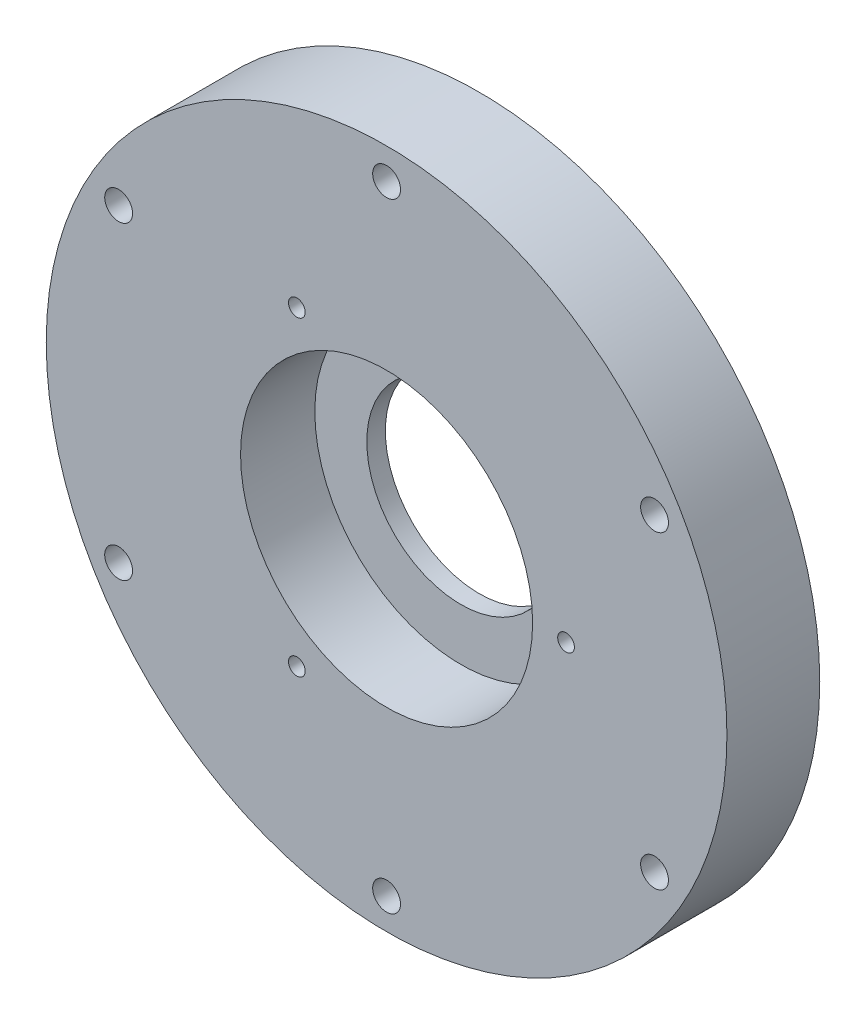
ISO-10303-21;
HEADER;
FILE_DESCRIPTION(('STEP AP214'),'2;1');
FILE_NAME('part.step','',(''),(''),'','','');
FILE_SCHEMA(('AUTOMOTIVE_DESIGN { 1 0 10303 214 1 1 1 1 }'));
ENDSEC;
DATA;
#1=APPLICATION_CONTEXT('core data for automotive mechanical design processes');
#2=APPLICATION_PROTOCOL_DEFINITION('international standard','automotive_design',2000,#1);
#3=PRODUCT_CONTEXT('',#1,'mechanical');
#4=PRODUCT('Part','Part','',(#3));
#5=PRODUCT_RELATED_PRODUCT_CATEGORY('part','',(#4));
#6=PRODUCT_DEFINITION_FORMATION('','',#4);
#7=PRODUCT_DEFINITION_CONTEXT('part definition',#1,'design');
#8=PRODUCT_DEFINITION('design','',#6,#7);
#9=PRODUCT_DEFINITION_SHAPE('','',#8);
#10=(LENGTH_UNIT() NAMED_UNIT(*) SI_UNIT(.MILLI.,.METRE.));
#11=(NAMED_UNIT(*) PLANE_ANGLE_UNIT() SI_UNIT($,.RADIAN.));
#12=(NAMED_UNIT(*) SI_UNIT($,.STERADIAN.) SOLID_ANGLE_UNIT());
#13=UNCERTAINTY_MEASURE_WITH_UNIT(LENGTH_MEASURE(1.E-05),#10,'distance_accuracy_value','');
#14=(GEOMETRIC_REPRESENTATION_CONTEXT(3) GLOBAL_UNCERTAINTY_ASSIGNED_CONTEXT((#13)) GLOBAL_UNIT_ASSIGNED_CONTEXT((#10,
#11,#12)) REPRESENTATION_CONTEXT('',''));
#15=CARTESIAN_POINT('',(0.,0.,0.));
#16=DIRECTION('',(0.,0.,1.));
#17=DIRECTION('',(1.,0.,0.));
#18=AXIS2_PLACEMENT_3D('',#15,#16,#17);
#19=CARTESIAN_POINT('',(29.,0.,6.));
#20=DIRECTION('',(0.,0.,1.));
#21=DIRECTION('',(1.,0.,0.));
#22=AXIS2_PLACEMENT_3D('',#19,#20,#21);
#23=PLANE('',#22);
#24=CARTESIAN_POINT('',(29.,0.,6.));
#25=DIRECTION('',(0.,0.,1.));
#26=DIRECTION('',(1.,0.,0.));
#27=AXIS2_PLACEMENT_3D('',#24,#25,#26);
#28=CIRCLE('',#27,1.35);
#29=CARTESIAN_POINT('',(30.35,0.,6.));
#30=VERTEX_POINT('',#29);
#31=EDGE_CURVE('E9',#30,#30,#28,.T.);
#32=ORIENTED_EDGE('',*,*,#31,.T.);
#33=EDGE_LOOP('',(#32));
#34=FACE_BOUND('',#33,.T.);
#35=ADVANCED_FACE('F14',(#34),#23,.T.);
#36=CARTESIAN_POINT('',(29.,0.,6.));
#37=DIRECTION('',(0.,0.,1.));
#38=DIRECTION('',(1.,0.,0.));
#39=AXIS2_PLACEMENT_3D('',#36,#37,#38);
#40=PLANE('',#39);
#41=CARTESIAN_POINT('',(-14.5,25.114736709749,6.));
#42=DIRECTION('',(0.,0.,1.));
#43=DIRECTION('',(1.,0.,0.));
#44=AXIS2_PLACEMENT_3D('',#41,#42,#43);
#45=CIRCLE('',#44,1.35);
#46=CARTESIAN_POINT('',(-13.15,25.114736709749,6.));
#47=VERTEX_POINT('',#46);
#48=EDGE_CURVE('E32',#47,#47,#45,.T.);
#49=ORIENTED_EDGE('',*,*,#48,.T.);
#50=EDGE_LOOP('',(#49));
#51=FACE_BOUND('',#50,.T.);
#52=ADVANCED_FACE('F16',(#51),#40,.T.);
#53=CARTESIAN_POINT('',(29.,0.,6.));
#54=DIRECTION('',(0.,0.,1.));
#55=DIRECTION('',(1.,0.,0.));
#56=AXIS2_PLACEMENT_3D('',#53,#54,#55);
#57=PLANE('',#56);
#58=CARTESIAN_POINT('',(-14.5,-25.11473670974,6.));
#59=DIRECTION('',(0.,0.,1.));
#60=DIRECTION('',(1.,0.,0.));
#61=AXIS2_PLACEMENT_3D('',#58,#59,#60);
#62=CIRCLE('',#61,1.35);
#63=CARTESIAN_POINT('',(-13.15,-25.11473670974,6.));
#64=VERTEX_POINT('',#63);
#65=EDGE_CURVE('E50',#64,#64,#62,.T.);
#66=ORIENTED_EDGE('',*,*,#65,.T.);
#67=EDGE_LOOP('',(#66));
#68=FACE_BOUND('',#67,.T.);
#69=ADVANCED_FACE('F256',(#68),#57,.T.);
#70=CARTESIAN_POINT('',(43.,0.,2.));
#71=DIRECTION('',(0.,0.,1.));
#72=DIRECTION('',(1.,0.,0.));
#73=AXIS2_PLACEMENT_3D('',#70,#71,#72);
#74=PLANE('',#73);
#75=CARTESIAN_POINT('',(13.287730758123,40.895430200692,2.));
#76=DIRECTION('',(0.,0.,1.));
#77=DIRECTION('',(1.,0.,0.));
#78=AXIS2_PLACEMENT_3D('',#75,#76,#77);
#79=CIRCLE('',#78,4.1);
#80=CARTESIAN_POINT('',(17.387730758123,40.895430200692,2.));
#81=VERTEX_POINT('',#80);
#82=EDGE_CURVE('E42',#81,#81,#79,.T.);
#83=ORIENTED_EDGE('',*,*,#82,.F.);
#84=EDGE_LOOP('',(#83));
#85=FACE_BOUND('',#84,.T.);
#86=ADVANCED_FACE('F306',(#85),#74,.F.);
#87=CARTESIAN_POINT('',(43.,0.,2.));
#88=DIRECTION('',(0.,0.,1.));
#89=DIRECTION('',(1.,0.,0.));
#90=AXIS2_PLACEMENT_3D('',#87,#88,#89);
#91=PLANE('',#90);
#92=CARTESIAN_POINT('',(34.787730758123,25.274765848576,2.));
#93=DIRECTION('',(0.,0.,1.));
#94=DIRECTION('',(1.,0.,0.));
#95=AXIS2_PLACEMENT_3D('',#92,#93,#94);
#96=CIRCLE('',#95,4.1);
#97=CARTESIAN_POINT('',(38.887730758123,25.274765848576,2.));
#98=VERTEX_POINT('',#97);
#99=EDGE_CURVE('E41',#98,#98,#96,.T.);
#100=ORIENTED_EDGE('',*,*,#99,.F.);
#101=EDGE_LOOP('',(#100));
#102=FACE_BOUND('',#101,.T.);
#103=ADVANCED_FACE('F308',(#102),#91,.F.);
#104=CARTESIAN_POINT('',(43.,0.,2.));
#105=DIRECTION('',(0.,0.,1.));
#106=DIRECTION('',(1.,0.,0.));
#107=AXIS2_PLACEMENT_3D('',#104,#105,#106);
#108=PLANE('',#107);
#109=CARTESIAN_POINT('',(43.,0.,2.));
#110=DIRECTION('',(0.,0.,1.));
#111=DIRECTION('',(1.,0.,0.));
#112=AXIS2_PLACEMENT_3D('',#109,#110,#111);
#113=CIRCLE('',#112,4.1);
#114=CARTESIAN_POINT('',(47.1,0.,2.));
#115=VERTEX_POINT('',#114);
#116=EDGE_CURVE('E37',#115,#115,#113,.T.);
#117=ORIENTED_EDGE('',*,*,#116,.F.);
#118=EDGE_LOOP('',(#117));
#119=FACE_BOUND('',#118,.T.);
#120=ADVANCED_FACE('F305',(#119),#108,.F.);
#121=CARTESIAN_POINT('',(0.,0.,3.));
#122=DIRECTION('',(0.,0.,1.));
#123=DIRECTION('',(1.,0.,0.));
#124=AXIS2_PLACEMENT_3D('',#121,#122,#123);
#125=PLANE('',#124);
#126=CARTESIAN_POINT('',(0.,0.,3.));
#127=DIRECTION('',(0.,0.,-1.));
#128=DIRECTION('',(1.,0.,0.));
#129=AXIS2_PLACEMENT_3D('',#126,#127,#128);
#130=CIRCLE('',#129,15.2);
#131=CARTESIAN_POINT('',(15.2,0.,3.));
#132=VERTEX_POINT('',#131);
#133=EDGE_CURVE('E40',#132,#132,#130,.T.);
#134=ORIENTED_EDGE('',*,*,#133,.T.);
#135=EDGE_LOOP('',(#134));
#136=FACE_BOUND('',#135,.T.);
#137=CARTESIAN_POINT('',(0.,0.,3.));
#138=DIRECTION('',(0.,0.,1.));
#139=DIRECTION('',(1.,0.,0.));
#140=AXIS2_PLACEMENT_3D('',#137,#138,#139);
#141=CIRCLE('',#140,23.6);
#142=CARTESIAN_POINT('',(23.6,0.,3.));
#143=VERTEX_POINT('',#142);
#144=EDGE_CURVE('E18',#143,#143,#141,.T.);
#145=ORIENTED_EDGE('',*,*,#144,.T.);
#146=EDGE_LOOP('',(#145));
#147=FACE_BOUND('',#146,.T.);
#148=ADVANCED_FACE('F297',(#136,#147),#125,.T.);
#149=CARTESIAN_POINT('',(43.,0.,2.));
#150=DIRECTION('',(0.,0.,1.));
#151=DIRECTION('',(1.,0.,0.));
#152=AXIS2_PLACEMENT_3D('',#149,#150,#151);
#153=PLANE('',#152);
#154=CARTESIAN_POINT('',(-13.28773075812,40.895430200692,2.));
#155=DIRECTION('',(0.,0.,1.));
#156=DIRECTION('',(1.,0.,0.));
#157=AXIS2_PLACEMENT_3D('',#154,#155,#156);
#158=CIRCLE('',#157,4.1);
#159=CARTESIAN_POINT('',(-9.18773075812,40.895430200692,2.));
#160=VERTEX_POINT('',#159);
#161=EDGE_CURVE('E34',#160,#160,#158,.T.);
#162=ORIENTED_EDGE('',*,*,#161,.F.);
#163=EDGE_LOOP('',(#162));
#164=FACE_BOUND('',#163,.T.);
#165=ADVANCED_FACE('F292',(#164),#153,.F.);
#166=CARTESIAN_POINT('',(43.,0.,2.));
#167=DIRECTION('',(0.,0.,1.));
#168=DIRECTION('',(1.,0.,0.));
#169=AXIS2_PLACEMENT_3D('',#166,#167,#168);
#170=PLANE('',#169);
#171=CARTESIAN_POINT('',(-34.78773075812,25.274765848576,2.));
#172=DIRECTION('',(0.,0.,1.));
#173=DIRECTION('',(1.,0.,0.));
#174=AXIS2_PLACEMENT_3D('',#171,#172,#173);
#175=CIRCLE('',#174,4.1);
#176=CARTESIAN_POINT('',(-30.68773075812,25.274765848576,2.));
#177=VERTEX_POINT('',#176);
#178=EDGE_CURVE('E103',#177,#177,#175,.T.);
#179=ORIENTED_EDGE('',*,*,#178,.F.);
#180=EDGE_LOOP('',(#179));
#181=FACE_BOUND('',#180,.T.);
#182=ADVANCED_FACE('F289',(#181),#170,.F.);
#183=CARTESIAN_POINT('',(43.,0.,2.));
#184=DIRECTION('',(0.,0.,1.));
#185=DIRECTION('',(1.,0.,0.));
#186=AXIS2_PLACEMENT_3D('',#183,#184,#185);
#187=PLANE('',#186);
#188=CARTESIAN_POINT('',(-43.,0.,2.));
#189=DIRECTION('',(0.,0.,1.));
#190=DIRECTION('',(1.,0.,0.));
#191=AXIS2_PLACEMENT_3D('',#188,#189,#190);
#192=CIRCLE('',#191,4.1);
#193=CARTESIAN_POINT('',(-38.9,0.,2.));
#194=VERTEX_POINT('',#193);
#195=EDGE_CURVE('E105',#194,#194,#192,.T.);
#196=ORIENTED_EDGE('',*,*,#195,.F.);
#197=EDGE_LOOP('',(#196));
#198=FACE_BOUND('',#197,.T.);
#199=ADVANCED_FACE('F286',(#198),#187,.F.);
#200=CARTESIAN_POINT('',(43.,0.,2.));
#201=DIRECTION('',(0.,0.,1.));
#202=DIRECTION('',(1.,0.,0.));
#203=AXIS2_PLACEMENT_3D('',#200,#201,#202);
#204=PLANE('',#203);
#205=CARTESIAN_POINT('',(34.787730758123,-25.27476584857,2.));
#206=DIRECTION('',(0.,0.,1.));
#207=DIRECTION('',(1.,0.,0.));
#208=AXIS2_PLACEMENT_3D('',#205,#206,#207);
#209=CIRCLE('',#208,4.1);
#210=CARTESIAN_POINT('',(38.887730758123,-25.27476584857,2.));
#211=VERTEX_POINT('',#210);
#212=EDGE_CURVE('E97',#211,#211,#209,.T.);
#213=ORIENTED_EDGE('',*,*,#212,.F.);
#214=EDGE_LOOP('',(#213));
#215=FACE_BOUND('',#214,.T.);
#216=ADVANCED_FACE('F282',(#215),#204,.F.);
#217=CARTESIAN_POINT('',(43.,0.,2.));
#218=DIRECTION('',(0.,0.,1.));
#219=DIRECTION('',(1.,0.,0.));
#220=AXIS2_PLACEMENT_3D('',#217,#218,#219);
#221=PLANE('',#220);
#222=CARTESIAN_POINT('',(13.287730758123,-40.89543020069,2.));
#223=DIRECTION('',(0.,0.,1.));
#224=DIRECTION('',(1.,0.,0.));
#225=AXIS2_PLACEMENT_3D('',#222,#223,#224);
#226=CIRCLE('',#225,4.1);
#227=CARTESIAN_POINT('',(17.387730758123,-40.89543020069,2.));
#228=VERTEX_POINT('',#227);
#229=EDGE_CURVE('E92',#228,#228,#226,.T.);
#230=ORIENTED_EDGE('',*,*,#229,.F.);
#231=EDGE_LOOP('',(#230));
#232=FACE_BOUND('',#231,.T.);
#233=ADVANCED_FACE('F279',(#232),#221,.F.);
#234=CARTESIAN_POINT('',(43.,0.,2.));
#235=DIRECTION('',(0.,0.,1.));
#236=DIRECTION('',(1.,0.,0.));
#237=AXIS2_PLACEMENT_3D('',#234,#235,#236);
#238=PLANE('',#237);
#239=CARTESIAN_POINT('',(-34.78773075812,-25.27476584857,2.));
#240=DIRECTION('',(0.,0.,1.));
#241=DIRECTION('',(1.,0.,0.));
#242=AXIS2_PLACEMENT_3D('',#239,#240,#241);
#243=CIRCLE('',#242,4.1);
#244=CARTESIAN_POINT('',(-30.68773075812,-25.27476584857,2.));
#245=VERTEX_POINT('',#244);
#246=EDGE_CURVE('E93',#245,#245,#243,.T.);
#247=ORIENTED_EDGE('',*,*,#246,.F.);
#248=EDGE_LOOP('',(#247));
#249=FACE_BOUND('',#248,.T.);
#250=ADVANCED_FACE('F273',(#249),#238,.F.);
#251=CARTESIAN_POINT('',(43.,0.,2.));
#252=DIRECTION('',(0.,0.,1.));
#253=DIRECTION('',(1.,0.,0.));
#254=AXIS2_PLACEMENT_3D('',#251,#252,#253);
#255=PLANE('',#254);
#256=CARTESIAN_POINT('',(-13.28773075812,-40.89543020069,2.));
#257=DIRECTION('',(0.,0.,1.));
#258=DIRECTION('',(1.,0.,0.));
#259=AXIS2_PLACEMENT_3D('',#256,#257,#258);
#260=CIRCLE('',#259,4.1);
#261=CARTESIAN_POINT('',(-9.18773075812,-40.89543020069,2.));
#262=VERTEX_POINT('',#261);
#263=EDGE_CURVE('E87',#262,#262,#260,.T.);
#264=ORIENTED_EDGE('',*,*,#263,.F.);
#265=EDGE_LOOP('',(#264));
#266=FACE_BOUND('',#265,.T.);
#267=ADVANCED_FACE('F269',(#266),#255,.F.);
#268=CARTESIAN_POINT('',(29.,0.,6.));
#269=DIRECTION('',(0.,0.,-1.));
#270=DIRECTION('',(1.,0.,0.));
#271=AXIS2_PLACEMENT_3D('',#268,#269,#270);
#272=CYLINDRICAL_SURFACE('',#271,1.35);
#273=CARTESIAN_POINT('',(29.,0.,15.));
#274=DIRECTION('',(0.,0.,1.));
#275=DIRECTION('',(1.,0.,0.));
#276=AXIS2_PLACEMENT_3D('',#273,#274,#275);
#277=CIRCLE('',#276,1.35);
#278=CARTESIAN_POINT('',(30.35,0.,15.));
#279=VERTEX_POINT('',#278);
#280=EDGE_CURVE('E84',#279,#279,#277,.T.);
#281=ORIENTED_EDGE('',*,*,#280,.T.);
#282=EDGE_LOOP('',(#281));
#283=FACE_BOUND('',#282,.T.);
#284=ORIENTED_EDGE('',*,*,#31,.F.);
#285=EDGE_LOOP('',(#284));
#286=FACE_BOUND('',#285,.T.);
#287=ADVANCED_FACE('F270',(#283,#286),#272,.F.);
#288=CARTESIAN_POINT('',(0.,0.,3.));
#289=DIRECTION('',(0.,0.,-1.));
#290=DIRECTION('',(1.,0.,0.));
#291=AXIS2_PLACEMENT_3D('',#288,#289,#290);
#292=CYLINDRICAL_SURFACE('',#291,23.6);
#293=CARTESIAN_POINT('',(0.,0.,15.));
#294=DIRECTION('',(0.,0.,1.));
#295=DIRECTION('',(1.,0.,0.));
#296=AXIS2_PLACEMENT_3D('',#293,#294,#295);
#297=CIRCLE('',#296,23.6);
#298=CARTESIAN_POINT('',(23.6,0.,15.));
#299=VERTEX_POINT('',#298);
#300=EDGE_CURVE('E80',#299,#299,#297,.T.);
#301=ORIENTED_EDGE('',*,*,#300,.T.);
#302=EDGE_LOOP('',(#301));
#303=FACE_BOUND('',#302,.T.);
#304=ORIENTED_EDGE('',*,*,#144,.F.);
#305=EDGE_LOOP('',(#304));
#306=FACE_BOUND('',#305,.T.);
#307=ADVANCED_FACE('F264',(#303,#306),#292,.F.);
#308=CARTESIAN_POINT('',(-14.5,25.114736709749,6.));
#309=DIRECTION('',(0.,0.,-1.));
#310=DIRECTION('',(1.,0.,0.));
#311=AXIS2_PLACEMENT_3D('',#308,#309,#310);
#312=CYLINDRICAL_SURFACE('',#311,1.35);
#313=CARTESIAN_POINT('',(-14.5,25.114736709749,15.));
#314=DIRECTION('',(0.,0.,1.));
#315=DIRECTION('',(1.,0.,0.));
#316=AXIS2_PLACEMENT_3D('',#313,#314,#315);
#317=CIRCLE('',#316,1.35);
#318=CARTESIAN_POINT('',(-13.15,25.114736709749,15.));
#319=VERTEX_POINT('',#318);
#320=EDGE_CURVE('E71',#319,#319,#317,.T.);
#321=ORIENTED_EDGE('',*,*,#320,.T.);
#322=EDGE_LOOP('',(#321));
#323=FACE_BOUND('',#322,.T.);
#324=ORIENTED_EDGE('',*,*,#48,.F.);
#325=EDGE_LOOP('',(#324));
#326=FACE_BOUND('',#325,.T.);
#327=ADVANCED_FACE('F265',(#323,#326),#312,.F.);
#328=CARTESIAN_POINT('',(-14.5,-25.11473670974,6.));
#329=DIRECTION('',(0.,0.,-1.));
#330=DIRECTION('',(1.,0.,0.));
#331=AXIS2_PLACEMENT_3D('',#328,#329,#330);
#332=CYLINDRICAL_SURFACE('',#331,1.35);
#333=CARTESIAN_POINT('',(-14.5,-25.11473670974,15.));
#334=DIRECTION('',(0.,0.,1.));
#335=DIRECTION('',(1.,0.,0.));
#336=AXIS2_PLACEMENT_3D('',#333,#334,#335);
#337=CIRCLE('',#336,1.35);
#338=CARTESIAN_POINT('',(-13.15,-25.11473670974,15.));
#339=VERTEX_POINT('',#338);
#340=EDGE_CURVE('E63',#339,#339,#337,.T.);
#341=ORIENTED_EDGE('',*,*,#340,.T.);
#342=EDGE_LOOP('',(#341));
#343=FACE_BOUND('',#342,.T.);
#344=ORIENTED_EDGE('',*,*,#65,.F.);
#345=EDGE_LOOP('',(#344));
#346=FACE_BOUND('',#345,.T.);
#347=ADVANCED_FACE('F193',(#343,#346),#332,.F.);
#348=CARTESIAN_POINT('',(13.287730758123,40.895430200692,0.));
#349=DIRECTION('',(0.,0.,-1.));
#350=DIRECTION('',(1.,0.,0.));
#351=AXIS2_PLACEMENT_3D('',#348,#349,#350);
#352=CYLINDRICAL_SURFACE('',#351,4.1);
#353=ORIENTED_EDGE('',*,*,#82,.T.);
#354=EDGE_LOOP('',(#353));
#355=FACE_BOUND('',#354,.T.);
#356=CARTESIAN_POINT('',(13.287730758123,40.895430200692,0.));
#357=DIRECTION('',(0.,0.,1.));
#358=DIRECTION('',(1.,0.,0.));
#359=AXIS2_PLACEMENT_3D('',#356,#357,#358);
#360=CIRCLE('',#359,4.1);
#361=CARTESIAN_POINT('',(17.387730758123,40.895430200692,0.));
#362=VERTEX_POINT('',#361);
#363=EDGE_CURVE('E178',#362,#362,#360,.T.);
#364=ORIENTED_EDGE('',*,*,#363,.F.);
#365=EDGE_LOOP('',(#364));
#366=FACE_BOUND('',#365,.T.);
#367=ADVANCED_FACE('F401',(#355,#366),#352,.F.);
#368=CARTESIAN_POINT('',(0.,50.,0.));
#369=DIRECTION('',(0.,0.,-1.));
#370=DIRECTION('',(1.,0.,0.));
#371=AXIS2_PLACEMENT_3D('',#368,#369,#370);
#372=CYLINDRICAL_SURFACE('',#371,2.25);
#373=CARTESIAN_POINT('',(0.,50.,15.));
#374=DIRECTION('',(0.,0.,1.));
#375=DIRECTION('',(1.,0.,0.));
#376=AXIS2_PLACEMENT_3D('',#373,#374,#375);
#377=CIRCLE('',#376,2.25);
#378=CARTESIAN_POINT('',(2.25,50.,15.));
#379=VERTEX_POINT('',#378);
#380=EDGE_CURVE('E85',#379,#379,#377,.T.);
#381=ORIENTED_EDGE('',*,*,#380,.T.);
#382=EDGE_LOOP('',(#381));
#383=FACE_BOUND('',#382,.T.);
#384=CARTESIAN_POINT('',(0.,50.,0.));
#385=DIRECTION('',(0.,0.,1.));
#386=DIRECTION('',(1.,0.,0.));
#387=AXIS2_PLACEMENT_3D('',#384,#385,#386);
#388=CIRCLE('',#387,2.25);
#389=CARTESIAN_POINT('',(2.25,50.,0.));
#390=VERTEX_POINT('',#389);
#391=EDGE_CURVE('E171',#390,#390,#388,.T.);
#392=ORIENTED_EDGE('',*,*,#391,.F.);
#393=EDGE_LOOP('',(#392));
#394=FACE_BOUND('',#393,.T.);
#395=ADVANCED_FACE('F408',(#383,#394),#372,.F.);
#396=CARTESIAN_POINT('',(43.301270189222,25.,0.));
#397=DIRECTION('',(0.,0.,-1.));
#398=DIRECTION('',(1.,0.,0.));
#399=AXIS2_PLACEMENT_3D('',#396,#397,#398);
#400=CYLINDRICAL_SURFACE('',#399,2.25);
#401=CARTESIAN_POINT('',(43.301270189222,25.,15.));
#402=DIRECTION('',(0.,0.,1.));
#403=DIRECTION('',(1.,0.,0.));
#404=AXIS2_PLACEMENT_3D('',#401,#402,#403);
#405=CIRCLE('',#404,2.25);
#406=CARTESIAN_POINT('',(45.551270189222,25.,15.));
#407=VERTEX_POINT('',#406);
#408=EDGE_CURVE('E77',#407,#407,#405,.T.);
#409=ORIENTED_EDGE('',*,*,#408,.T.);
#410=EDGE_LOOP('',(#409));
#411=FACE_BOUND('',#410,.T.);
#412=CARTESIAN_POINT('',(43.301270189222,25.,0.));
#413=DIRECTION('',(0.,0.,1.));
#414=DIRECTION('',(1.,0.,0.));
#415=AXIS2_PLACEMENT_3D('',#412,#413,#414);
#416=CIRCLE('',#415,2.25);
#417=CARTESIAN_POINT('',(45.551270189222,25.,0.));
#418=VERTEX_POINT('',#417);
#419=EDGE_CURVE('E170',#418,#418,#416,.T.);
#420=ORIENTED_EDGE('',*,*,#419,.F.);
#421=EDGE_LOOP('',(#420));
#422=FACE_BOUND('',#421,.T.);
#423=ADVANCED_FACE('F246',(#411,#422),#400,.F.);
#424=CARTESIAN_POINT('',(34.787730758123,25.274765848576,0.));
#425=DIRECTION('',(0.,0.,-1.));
#426=DIRECTION('',(1.,0.,0.));
#427=AXIS2_PLACEMENT_3D('',#424,#425,#426);
#428=CYLINDRICAL_SURFACE('',#427,4.1);
#429=ORIENTED_EDGE('',*,*,#99,.T.);
#430=EDGE_LOOP('',(#429));
#431=FACE_BOUND('',#430,.T.);
#432=CARTESIAN_POINT('',(34.787730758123,25.274765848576,0.));
#433=DIRECTION('',(0.,0.,1.));
#434=DIRECTION('',(1.,0.,0.));
#435=AXIS2_PLACEMENT_3D('',#432,#433,#434);
#436=CIRCLE('',#435,4.1);
#437=CARTESIAN_POINT('',(38.887730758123,25.274765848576,0.));
#438=VERTEX_POINT('',#437);
#439=EDGE_CURVE('E162',#438,#438,#436,.T.);
#440=ORIENTED_EDGE('',*,*,#439,.F.);
#441=EDGE_LOOP('',(#440));
#442=FACE_BOUND('',#441,.T.);
#443=ADVANCED_FACE('F238',(#431,#442),#428,.F.);
#444=CARTESIAN_POINT('',(43.,0.,0.));
#445=DIRECTION('',(0.,0.,-1.));
#446=DIRECTION('',(1.,0.,0.));
#447=AXIS2_PLACEMENT_3D('',#444,#445,#446);
#448=CYLINDRICAL_SURFACE('',#447,4.1);
#449=ORIENTED_EDGE('',*,*,#116,.T.);
#450=EDGE_LOOP('',(#449));
#451=FACE_BOUND('',#450,.T.);
#452=CARTESIAN_POINT('',(43.,0.,0.));
#453=DIRECTION('',(0.,0.,1.));
#454=DIRECTION('',(1.,0.,0.));
#455=AXIS2_PLACEMENT_3D('',#452,#453,#454);
#456=CIRCLE('',#455,4.1);
#457=CARTESIAN_POINT('',(47.1,0.,0.));
#458=VERTEX_POINT('',#457);
#459=EDGE_CURVE('E165',#458,#458,#456,.T.);
#460=ORIENTED_EDGE('',*,*,#459,.F.);
#461=EDGE_LOOP('',(#460));
#462=FACE_BOUND('',#461,.T.);
#463=ADVANCED_FACE('F234',(#451,#462),#448,.F.);
#464=CARTESIAN_POINT('',(0.,0.,0.));
#465=DIRECTION('',(0.,0.,-1.));
#466=DIRECTION('',(1.,0.,0.));
#467=AXIS2_PLACEMENT_3D('',#464,#465,#466);
#468=CYLINDRICAL_SURFACE('',#467,15.2);
#469=ORIENTED_EDGE('',*,*,#133,.F.);
#470=EDGE_LOOP('',(#469));
#471=FACE_BOUND('',#470,.T.);
#472=CARTESIAN_POINT('',(0.,0.,0.));
#473=DIRECTION('',(0.,0.,1.));
#474=DIRECTION('',(1.,0.,0.));
#475=AXIS2_PLACEMENT_3D('',#472,#473,#474);
#476=CIRCLE('',#475,15.2);
#477=CARTESIAN_POINT('',(15.2,0.,0.));
#478=VERTEX_POINT('',#477);
#479=EDGE_CURVE('E134',#478,#478,#476,.T.);
#480=ORIENTED_EDGE('',*,*,#479,.F.);
#481=EDGE_LOOP('',(#480));
#482=FACE_BOUND('',#481,.T.);
#483=ADVANCED_FACE('F236',(#471,#482),#468,.F.);
#484=CARTESIAN_POINT('',(-13.28773075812,40.895430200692,0.));
#485=DIRECTION('',(0.,0.,-1.));
#486=DIRECTION('',(1.,0.,0.));
#487=AXIS2_PLACEMENT_3D('',#484,#485,#486);
#488=CYLINDRICAL_SURFACE('',#487,4.1);
#489=ORIENTED_EDGE('',*,*,#161,.T.);
#490=EDGE_LOOP('',(#489));
#491=FACE_BOUND('',#490,.T.);
#492=CARTESIAN_POINT('',(-13.28773075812,40.895430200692,0.));
#493=DIRECTION('',(0.,0.,1.));
#494=DIRECTION('',(1.,0.,0.));
#495=AXIS2_PLACEMENT_3D('',#492,#493,#494);
#496=CIRCLE('',#495,4.1);
#497=CARTESIAN_POINT('',(-9.18773075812,40.895430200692,0.));
#498=VERTEX_POINT('',#497);
#499=EDGE_CURVE('E131',#498,#498,#496,.T.);
#500=ORIENTED_EDGE('',*,*,#499,.F.);
#501=EDGE_LOOP('',(#500));
#502=FACE_BOUND('',#501,.T.);
#503=ADVANCED_FACE('F247',(#491,#502),#488,.F.);
#504=CARTESIAN_POINT('',(-34.78773075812,25.274765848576,0.));
#505=DIRECTION('',(0.,0.,-1.));
#506=DIRECTION('',(1.,0.,0.));
#507=AXIS2_PLACEMENT_3D('',#504,#505,#506);
#508=CYLINDRICAL_SURFACE('',#507,4.1);
#509=ORIENTED_EDGE('',*,*,#178,.T.);
#510=EDGE_LOOP('',(#509));
#511=FACE_BOUND('',#510,.T.);
#512=CARTESIAN_POINT('',(-34.78773075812,25.274765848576,0.));
#513=DIRECTION('',(0.,0.,1.));
#514=DIRECTION('',(1.,0.,0.));
#515=AXIS2_PLACEMENT_3D('',#512,#513,#514);
#516=CIRCLE('',#515,4.1);
#517=CARTESIAN_POINT('',(-30.68773075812,25.274765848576,0.));
#518=VERTEX_POINT('',#517);
#519=EDGE_CURVE('E137',#518,#518,#516,.T.);
#520=ORIENTED_EDGE('',*,*,#519,.F.);
#521=EDGE_LOOP('',(#520));
#522=FACE_BOUND('',#521,.T.);
#523=ADVANCED_FACE('F453',(#511,#522),#508,.F.);
#524=CARTESIAN_POINT('',(-43.30127018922,25.,0.));
#525=DIRECTION('',(0.,0.,-1.));
#526=DIRECTION('',(1.,0.,0.));
#527=AXIS2_PLACEMENT_3D('',#524,#525,#526);
#528=CYLINDRICAL_SURFACE('',#527,2.25);
#529=CARTESIAN_POINT('',(-43.30127018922,25.,15.));
#530=DIRECTION('',(0.,0.,1.));
#531=DIRECTION('',(1.,0.,0.));
#532=AXIS2_PLACEMENT_3D('',#529,#530,#531);
#533=CIRCLE('',#532,2.25);
#534=CARTESIAN_POINT('',(-41.05127018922,25.,15.));
#535=VERTEX_POINT('',#534);
#536=EDGE_CURVE('E67',#535,#535,#533,.T.);
#537=ORIENTED_EDGE('',*,*,#536,.T.);
#538=EDGE_LOOP('',(#537));
#539=FACE_BOUND('',#538,.T.);
#540=CARTESIAN_POINT('',(-43.30127018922,25.,0.));
#541=DIRECTION('',(0.,0.,1.));
#542=DIRECTION('',(1.,0.,0.));
#543=AXIS2_PLACEMENT_3D('',#540,#541,#542);
#544=CIRCLE('',#543,2.25);
#545=CARTESIAN_POINT('',(-41.05127018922,25.,0.));
#546=VERTEX_POINT('',#545);
#547=EDGE_CURVE('E155',#546,#546,#544,.T.);
#548=ORIENTED_EDGE('',*,*,#547,.F.);
#549=EDGE_LOOP('',(#548));
#550=FACE_BOUND('',#549,.T.);
#551=ADVANCED_FACE('F464',(#539,#550),#528,.F.);
#552=CARTESIAN_POINT('',(-43.,0.,0.));
#553=DIRECTION('',(0.,0.,-1.));
#554=DIRECTION('',(1.,0.,0.));
#555=AXIS2_PLACEMENT_3D('',#552,#553,#554);
#556=CYLINDRICAL_SURFACE('',#555,4.1);
#557=ORIENTED_EDGE('',*,*,#195,.T.);
#558=EDGE_LOOP('',(#557));
#559=FACE_BOUND('',#558,.T.);
#560=CARTESIAN_POINT('',(-43.,0.,0.));
#561=DIRECTION('',(0.,0.,1.));
#562=DIRECTION('',(1.,0.,0.));
#563=AXIS2_PLACEMENT_3D('',#560,#561,#562);
#564=CIRCLE('',#563,4.1);
#565=CARTESIAN_POINT('',(-38.9,0.,0.));
#566=VERTEX_POINT('',#565);
#567=EDGE_CURVE('E146',#566,#566,#564,.T.);
#568=ORIENTED_EDGE('',*,*,#567,.F.);
#569=EDGE_LOOP('',(#568));
#570=FACE_BOUND('',#569,.T.);
#571=ADVANCED_FACE('F474',(#559,#570),#556,.F.);
#572=CARTESIAN_POINT('',(43.301270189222,-25.,0.));
#573=DIRECTION('',(0.,0.,-1.));
#574=DIRECTION('',(1.,0.,0.));
#575=AXIS2_PLACEMENT_3D('',#572,#573,#574);
#576=CYLINDRICAL_SURFACE('',#575,2.25);
#577=CARTESIAN_POINT('',(43.301270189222,-25.,15.));
#578=DIRECTION('',(0.,0.,1.));
#579=DIRECTION('',(1.,0.,0.));
#580=AXIS2_PLACEMENT_3D('',#577,#578,#579);
#581=CIRCLE('',#580,2.25);
#582=CARTESIAN_POINT('',(45.551270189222,-25.,15.));
#583=VERTEX_POINT('',#582);
#584=EDGE_CURVE('E66',#583,#583,#581,.T.);
#585=ORIENTED_EDGE('',*,*,#584,.T.);
#586=EDGE_LOOP('',(#585));
#587=FACE_BOUND('',#586,.T.);
#588=CARTESIAN_POINT('',(43.301270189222,-25.,0.));
#589=DIRECTION('',(0.,0.,1.));
#590=DIRECTION('',(1.,0.,0.));
#591=AXIS2_PLACEMENT_3D('',#588,#589,#590);
#592=CIRCLE('',#591,2.25);
#593=CARTESIAN_POINT('',(45.551270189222,-25.,0.));
#594=VERTEX_POINT('',#593);
#595=EDGE_CURVE('E150',#594,#594,#592,.T.);
#596=ORIENTED_EDGE('',*,*,#595,.F.);
#597=EDGE_LOOP('',(#596));
#598=FACE_BOUND('',#597,.T.);
#599=ADVANCED_FACE('F486',(#587,#598),#576,.F.);
#600=CARTESIAN_POINT('',(34.787730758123,-25.27476584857,0.));
#601=DIRECTION('',(0.,0.,-1.));
#602=DIRECTION('',(1.,0.,0.));
#603=AXIS2_PLACEMENT_3D('',#600,#601,#602);
#604=CYLINDRICAL_SURFACE('',#603,4.1);
#605=ORIENTED_EDGE('',*,*,#212,.T.);
#606=EDGE_LOOP('',(#605));
#607=FACE_BOUND('',#606,.T.);
#608=CARTESIAN_POINT('',(34.787730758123,-25.27476584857,0.));
#609=DIRECTION('',(0.,0.,1.));
#610=DIRECTION('',(1.,0.,0.));
#611=AXIS2_PLACEMENT_3D('',#608,#609,#610);
#612=CIRCLE('',#611,4.1);
#613=CARTESIAN_POINT('',(38.887730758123,-25.27476584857,0.));
#614=VERTEX_POINT('',#613);
#615=EDGE_CURVE('E141',#614,#614,#612,.T.);
#616=ORIENTED_EDGE('',*,*,#615,.F.);
#617=EDGE_LOOP('',(#616));
#618=FACE_BOUND('',#617,.T.);
#619=ADVANCED_FACE('F497',(#607,#618),#604,.F.);
#620=CARTESIAN_POINT('',(13.287730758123,-40.89543020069,0.));
#621=DIRECTION('',(0.,0.,-1.));
#622=DIRECTION('',(1.,0.,0.));
#623=AXIS2_PLACEMENT_3D('',#620,#621,#622);
#624=CYLINDRICAL_SURFACE('',#623,4.1);
#625=ORIENTED_EDGE('',*,*,#229,.T.);
#626=EDGE_LOOP('',(#625));
#627=FACE_BOUND('',#626,.T.);
#628=CARTESIAN_POINT('',(13.287730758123,-40.89543020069,0.));
#629=DIRECTION('',(0.,0.,1.));
#630=DIRECTION('',(1.,0.,0.));
#631=AXIS2_PLACEMENT_3D('',#628,#629,#630);
#632=CIRCLE('',#631,4.1);
#633=CARTESIAN_POINT('',(17.387730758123,-40.89543020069,0.));
#634=VERTEX_POINT('',#633);
#635=EDGE_CURVE('E120',#634,#634,#632,.T.);
#636=ORIENTED_EDGE('',*,*,#635,.F.);
#637=EDGE_LOOP('',(#636));
#638=FACE_BOUND('',#637,.T.);
#639=ADVANCED_FACE('F505',(#627,#638),#624,.F.);
#640=CARTESIAN_POINT('',(-34.78773075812,-25.27476584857,0.));
#641=DIRECTION('',(0.,0.,-1.));
#642=DIRECTION('',(1.,0.,0.));
#643=AXIS2_PLACEMENT_3D('',#640,#641,#642);
#644=CYLINDRICAL_SURFACE('',#643,4.1);
#645=ORIENTED_EDGE('',*,*,#246,.T.);
#646=EDGE_LOOP('',(#645));
#647=FACE_BOUND('',#646,.T.);
#648=CARTESIAN_POINT('',(-34.78773075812,-25.27476584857,0.));
#649=DIRECTION('',(0.,0.,1.));
#650=DIRECTION('',(1.,0.,0.));
#651=AXIS2_PLACEMENT_3D('',#648,#649,#650);
#652=CIRCLE('',#651,4.1);
#653=CARTESIAN_POINT('',(-30.68773075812,-25.27476584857,0.));
#654=VERTEX_POINT('',#653);
#655=EDGE_CURVE('E129',#654,#654,#652,.T.);
#656=ORIENTED_EDGE('',*,*,#655,.F.);
#657=EDGE_LOOP('',(#656));
#658=FACE_BOUND('',#657,.T.);
#659=ADVANCED_FACE('F514',(#647,#658),#644,.F.);
#660=CARTESIAN_POINT('',(-43.30127018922,-25.,0.));
#661=DIRECTION('',(0.,0.,-1.));
#662=DIRECTION('',(1.,0.,0.));
#663=AXIS2_PLACEMENT_3D('',#660,#661,#662);
#664=CYLINDRICAL_SURFACE('',#663,2.25);
#665=CARTESIAN_POINT('',(-43.30127018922,-25.,15.));
#666=DIRECTION('',(0.,0.,1.));
#667=DIRECTION('',(1.,0.,0.));
#668=AXIS2_PLACEMENT_3D('',#665,#666,#667);
#669=CIRCLE('',#668,2.25);
#670=CARTESIAN_POINT('',(-41.05127018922,-25.,15.));
#671=VERTEX_POINT('',#670);
#672=EDGE_CURVE('E184',#671,#671,#669,.T.);
#673=ORIENTED_EDGE('',*,*,#672,.T.);
#674=EDGE_LOOP('',(#673));
#675=FACE_BOUND('',#674,.T.);
#676=CARTESIAN_POINT('',(-43.30127018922,-25.,0.));
#677=DIRECTION('',(0.,0.,1.));
#678=DIRECTION('',(1.,0.,0.));
#679=AXIS2_PLACEMENT_3D('',#676,#677,#678);
#680=CIRCLE('',#679,2.25);
#681=CARTESIAN_POINT('',(-41.05127018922,-25.,0.));
#682=VERTEX_POINT('',#681);
#683=EDGE_CURVE('E124',#682,#682,#680,.T.);
#684=ORIENTED_EDGE('',*,*,#683,.F.);
#685=EDGE_LOOP('',(#684));
#686=FACE_BOUND('',#685,.T.);
#687=ADVANCED_FACE('F523',(#675,#686),#664,.F.);
#688=CARTESIAN_POINT('',(0.,-50.,0.));
#689=DIRECTION('',(0.,0.,-1.));
#690=DIRECTION('',(1.,0.,0.));
#691=AXIS2_PLACEMENT_3D('',#688,#689,#690);
#692=CYLINDRICAL_SURFACE('',#691,2.25);
#693=CARTESIAN_POINT('',(0.,-50.,15.));
#694=DIRECTION('',(0.,0.,1.));
#695=DIRECTION('',(1.,0.,0.));
#696=AXIS2_PLACEMENT_3D('',#693,#694,#695);
#697=CIRCLE('',#696,2.25);
#698=CARTESIAN_POINT('',(2.24999999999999,-50.,15.));
#699=VERTEX_POINT('',#698);
#700=EDGE_CURVE('E181',#699,#699,#697,.T.);
#701=ORIENTED_EDGE('',*,*,#700,.T.);
#702=EDGE_LOOP('',(#701));
#703=FACE_BOUND('',#702,.T.);
#704=CARTESIAN_POINT('',(0.,-50.,0.));
#705=DIRECTION('',(0.,0.,1.));
#706=DIRECTION('',(1.,0.,0.));
#707=AXIS2_PLACEMENT_3D('',#704,#705,#706);
#708=CIRCLE('',#707,2.25);
#709=CARTESIAN_POINT('',(2.24999999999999,-50.,0.));
#710=VERTEX_POINT('',#709);
#711=EDGE_CURVE('E125',#710,#710,#708,.T.);
#712=ORIENTED_EDGE('',*,*,#711,.F.);
#713=EDGE_LOOP('',(#712));
#714=FACE_BOUND('',#713,.T.);
#715=ADVANCED_FACE('F532',(#703,#714),#692,.F.);
#716=CARTESIAN_POINT('',(-13.28773075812,-40.89543020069,0.));
#717=DIRECTION('',(0.,0.,-1.));
#718=DIRECTION('',(1.,0.,0.));
#719=AXIS2_PLACEMENT_3D('',#716,#717,#718);
#720=CYLINDRICAL_SURFACE('',#719,4.1);
#721=ORIENTED_EDGE('',*,*,#263,.T.);
#722=EDGE_LOOP('',(#721));
#723=FACE_BOUND('',#722,.T.);
#724=CARTESIAN_POINT('',(-13.28773075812,-40.89543020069,0.));
#725=DIRECTION('',(0.,0.,1.));
#726=DIRECTION('',(1.,0.,0.));
#727=AXIS2_PLACEMENT_3D('',#724,#725,#726);
#728=CIRCLE('',#727,4.1);
#729=CARTESIAN_POINT('',(-9.18773075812,-40.89543020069,0.));
#730=VERTEX_POINT('',#729);
#731=EDGE_CURVE('E130',#730,#730,#728,.T.);
#732=ORIENTED_EDGE('',*,*,#731,.F.);
#733=EDGE_LOOP('',(#732));
#734=FACE_BOUND('',#733,.T.);
#735=ADVANCED_FACE('F205',(#723,#734),#720,.F.);
#736=CARTESIAN_POINT('',(0.,0.,15.));
#737=DIRECTION('',(0.,0.,1.));
#738=DIRECTION('',(1.,0.,0.));
#739=AXIS2_PLACEMENT_3D('',#736,#737,#738);
#740=PLANE('',#739);
#741=ORIENTED_EDGE('',*,*,#380,.F.);
#742=EDGE_LOOP('',(#741));
#743=FACE_BOUND('',#742,.T.);
#744=ORIENTED_EDGE('',*,*,#408,.F.);
#745=EDGE_LOOP('',(#744));
#746=FACE_BOUND('',#745,.T.);
#747=ORIENTED_EDGE('',*,*,#280,.F.);
#748=EDGE_LOOP('',(#747));
#749=FACE_BOUND('',#748,.T.);
#750=ORIENTED_EDGE('',*,*,#300,.F.);
#751=EDGE_LOOP('',(#750));
#752=FACE_BOUND('',#751,.T.);
#753=ORIENTED_EDGE('',*,*,#320,.F.);
#754=EDGE_LOOP('',(#753));
#755=FACE_BOUND('',#754,.T.);
#756=ORIENTED_EDGE('',*,*,#536,.F.);
#757=EDGE_LOOP('',(#756));
#758=FACE_BOUND('',#757,.T.);
#759=ORIENTED_EDGE('',*,*,#584,.F.);
#760=EDGE_LOOP('',(#759));
#761=FACE_BOUND('',#760,.T.);
#762=ORIENTED_EDGE('',*,*,#340,.F.);
#763=EDGE_LOOP('',(#762));
#764=FACE_BOUND('',#763,.T.);
#765=ORIENTED_EDGE('',*,*,#672,.F.);
#766=EDGE_LOOP('',(#765));
#767=FACE_BOUND('',#766,.T.);
#768=ORIENTED_EDGE('',*,*,#700,.F.);
#769=EDGE_LOOP('',(#768));
#770=FACE_BOUND('',#769,.T.);
#771=CARTESIAN_POINT('',(0.,0.,15.));
#772=DIRECTION('',(0.,0.,1.));
#773=DIRECTION('',(1.,0.,0.));
#774=AXIS2_PLACEMENT_3D('',#771,#772,#773);
#775=CIRCLE('',#774,55.);
#776=CARTESIAN_POINT('',(55.,0.,15.));
#777=VERTEX_POINT('',#776);
#778=EDGE_CURVE('E209',#777,#777,#775,.T.);
#779=ORIENTED_EDGE('',*,*,#778,.T.);
#780=EDGE_LOOP('',(#779));
#781=FACE_BOUND('',#780,.T.);
#782=ADVANCED_FACE('F196',(#743,#746,#749,#752,#755,#758,#761,#764,#767,#770,#781),#740,.T.);
#783=CARTESIAN_POINT('',(0.,0.,0.));
#784=DIRECTION('',(0.,0.,1.));
#785=DIRECTION('',(1.,0.,0.));
#786=AXIS2_PLACEMENT_3D('',#783,#784,#785);
#787=PLANE('',#786);
#788=ORIENTED_EDGE('',*,*,#363,.T.);
#789=EDGE_LOOP('',(#788));
#790=FACE_BOUND('',#789,.T.);
#791=ORIENTED_EDGE('',*,*,#391,.T.);
#792=EDGE_LOOP('',(#791));
#793=FACE_BOUND('',#792,.T.);
#794=ORIENTED_EDGE('',*,*,#419,.T.);
#795=EDGE_LOOP('',(#794));
#796=FACE_BOUND('',#795,.T.);
#797=ORIENTED_EDGE('',*,*,#439,.T.);
#798=EDGE_LOOP('',(#797));
#799=FACE_BOUND('',#798,.T.);
#800=ORIENTED_EDGE('',*,*,#459,.T.);
#801=EDGE_LOOP('',(#800));
#802=FACE_BOUND('',#801,.T.);
#803=ORIENTED_EDGE('',*,*,#479,.T.);
#804=EDGE_LOOP('',(#803));
#805=FACE_BOUND('',#804,.T.);
#806=ORIENTED_EDGE('',*,*,#499,.T.);
#807=EDGE_LOOP('',(#806));
#808=FACE_BOUND('',#807,.T.);
#809=ORIENTED_EDGE('',*,*,#519,.T.);
#810=EDGE_LOOP('',(#809));
#811=FACE_BOUND('',#810,.T.);
#812=ORIENTED_EDGE('',*,*,#547,.T.);
#813=EDGE_LOOP('',(#812));
#814=FACE_BOUND('',#813,.T.);
#815=ORIENTED_EDGE('',*,*,#567,.T.);
#816=EDGE_LOOP('',(#815));
#817=FACE_BOUND('',#816,.T.);
#818=ORIENTED_EDGE('',*,*,#595,.T.);
#819=EDGE_LOOP('',(#818));
#820=FACE_BOUND('',#819,.T.);
#821=ORIENTED_EDGE('',*,*,#615,.T.);
#822=EDGE_LOOP('',(#821));
#823=FACE_BOUND('',#822,.T.);
#824=ORIENTED_EDGE('',*,*,#635,.T.);
#825=EDGE_LOOP('',(#824));
#826=FACE_BOUND('',#825,.T.);
#827=ORIENTED_EDGE('',*,*,#655,.T.);
#828=EDGE_LOOP('',(#827));
#829=FACE_BOUND('',#828,.T.);
#830=ORIENTED_EDGE('',*,*,#683,.T.);
#831=EDGE_LOOP('',(#830));
#832=FACE_BOUND('',#831,.T.);
#833=ORIENTED_EDGE('',*,*,#711,.T.);
#834=EDGE_LOOP('',(#833));
#835=FACE_BOUND('',#834,.T.);
#836=ORIENTED_EDGE('',*,*,#731,.T.);
#837=EDGE_LOOP('',(#836));
#838=FACE_BOUND('',#837,.T.);
#839=CARTESIAN_POINT('',(0.,0.,0.));
#840=DIRECTION('',(0.,0.,1.));
#841=DIRECTION('',(1.,0.,0.));
#842=AXIS2_PLACEMENT_3D('',#839,#840,#841);
#843=CIRCLE('',#842,55.);
#844=CARTESIAN_POINT('',(55.,0.,0.));
#845=VERTEX_POINT('',#844);
#846=EDGE_CURVE('E213',#845,#845,#843,.T.);
#847=ORIENTED_EDGE('',*,*,#846,.F.);
#848=EDGE_LOOP('',(#847));
#849=FACE_BOUND('',#848,.T.);
#850=ADVANCED_FACE('F203',(#790,#793,#796,#799,#802,#805,#808,#811,#814,#817,#820,#823,#826,
#829,#832,#835,#838,#849),#787,.F.);
#851=CARTESIAN_POINT('',(0.,0.,0.));
#852=DIRECTION('',(0.,0.,-1.));
#853=DIRECTION('',(1.,0.,0.));
#854=AXIS2_PLACEMENT_3D('',#851,#852,#853);
#855=CYLINDRICAL_SURFACE('',#854,55.);
#856=ORIENTED_EDGE('',*,*,#778,.F.);
#857=EDGE_LOOP('',(#856));
#858=FACE_BOUND('',#857,.T.);
#859=ORIENTED_EDGE('',*,*,#846,.T.);
#860=EDGE_LOOP('',(#859));
#861=FACE_BOUND('',#860,.T.);
#862=ADVANCED_FACE('F562',(#858,#861),#855,.T.);
#863=CLOSED_SHELL('',(#35,#52,#69,#86,#103,#120,#148,#165,#182,#199,#216,#233,#250,#267,#287,
#307,#327,#347,#367,#395,#423,#443,#463,#483,#503,#523,#551,#571,#599,#619,#639,#659,#687,#715,
#735,#782,#850,#862));
#864=MANIFOLD_SOLID_BREP('B1',#863);
#865=ADVANCED_BREP_SHAPE_REPRESENTATION('',(#18,#864),#14);
#866=SHAPE_DEFINITION_REPRESENTATION(#9,#865);
ENDSEC;
END-ISO-10303-21;
